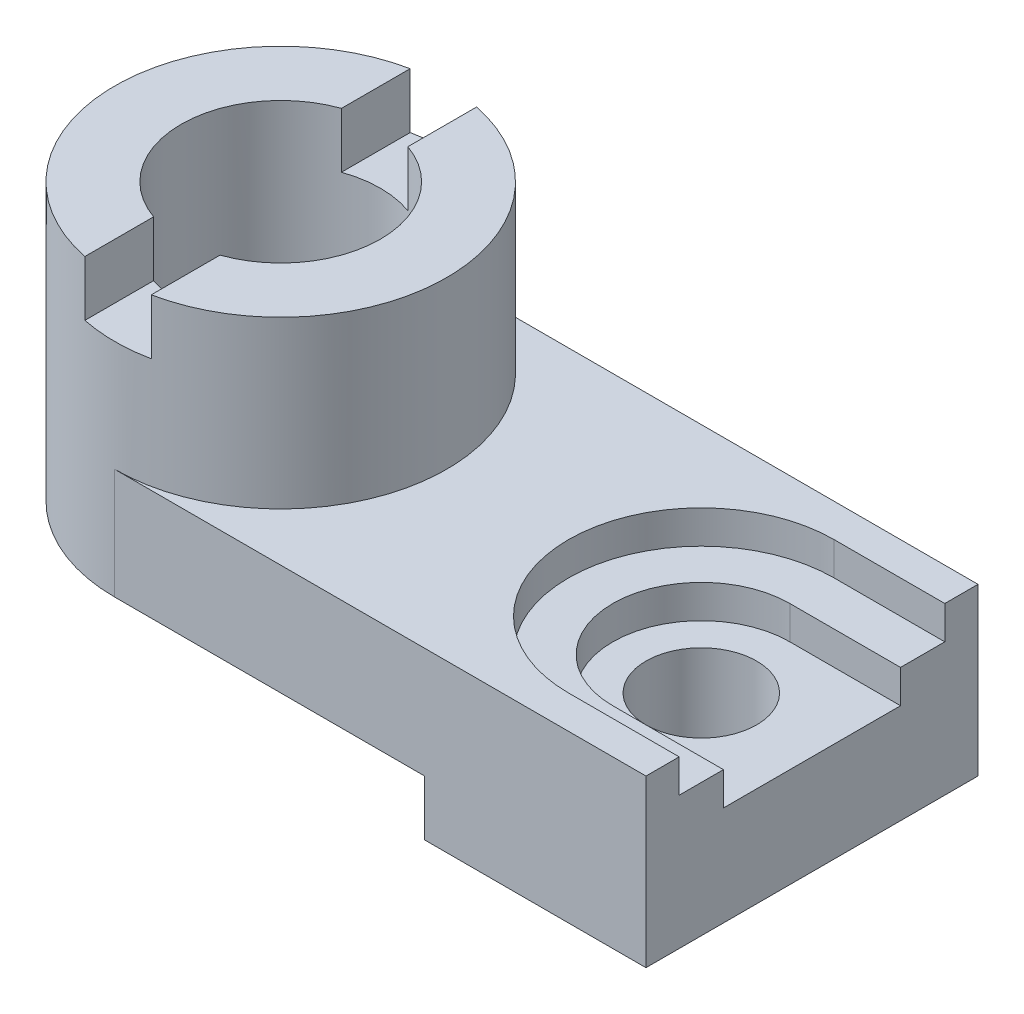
ISO-10303-21;
HEADER;
FILE_DESCRIPTION(('STEP AP214'),'2;1');
FILE_NAME('part.step','',(''),(''),'','','');
FILE_SCHEMA(('AUTOMOTIVE_DESIGN { 1 0 10303 214 1 1 1 1 }'));
ENDSEC;
DATA;
#1=APPLICATION_CONTEXT('core data for automotive mechanical design processes');
#2=APPLICATION_PROTOCOL_DEFINITION('international standard','automotive_design',2000,#1);
#3=PRODUCT_CONTEXT('',#1,'mechanical');
#4=PRODUCT('Part','Part','',(#3));
#5=PRODUCT_RELATED_PRODUCT_CATEGORY('part','',(#4));
#6=PRODUCT_DEFINITION_FORMATION('','',#4);
#7=PRODUCT_DEFINITION_CONTEXT('part definition',#1,'design');
#8=PRODUCT_DEFINITION('design','',#6,#7);
#9=PRODUCT_DEFINITION_SHAPE('','',#8);
#10=(LENGTH_UNIT() NAMED_UNIT(*) SI_UNIT(.MILLI.,.METRE.));
#11=(NAMED_UNIT(*) PLANE_ANGLE_UNIT() SI_UNIT($,.RADIAN.));
#12=(NAMED_UNIT(*) SI_UNIT($,.STERADIAN.) SOLID_ANGLE_UNIT());
#13=UNCERTAINTY_MEASURE_WITH_UNIT(LENGTH_MEASURE(1.E-05),#10,'distance_accuracy_value','');
#14=(GEOMETRIC_REPRESENTATION_CONTEXT(3) GLOBAL_UNCERTAINTY_ASSIGNED_CONTEXT((#13)) GLOBAL_UNIT_ASSIGNED_CONTEXT((#10,
#11,#12)) REPRESENTATION_CONTEXT('',''));
#15=CARTESIAN_POINT('',(0.,0.,0.));
#16=DIRECTION('',(0.,0.,1.));
#17=DIRECTION('',(1.,0.,0.));
#18=AXIS2_PLACEMENT_3D('',#15,#16,#17);
#19=CARTESIAN_POINT('',(38.,10.,0.));
#20=DIRECTION('',(0.,-1.,0.));
#21=DIRECTION('',(0.,0.,-1.));
#22=AXIS2_PLACEMENT_3D('',#19,#20,#21);
#23=CYLINDRICAL_SURFACE('',#22,5.);
#24=CARTESIAN_POINT('',(38.,-5.,0.));
#25=DIRECTION('',(0.,1.,0.));
#26=DIRECTION('',(0.,0.,1.));
#27=AXIS2_PLACEMENT_3D('',#24,#25,#26);
#28=CIRCLE('',#27,5.);
#29=CARTESIAN_POINT('',(38.,-5.,5.));
#30=VERTEX_POINT('',#29);
#31=EDGE_CURVE('E236',#30,#30,#28,.T.);
#32=ORIENTED_EDGE('',*,*,#31,.F.);
#33=EDGE_LOOP('',(#32));
#34=FACE_BOUND('',#33,.T.);
#35=CARTESIAN_POINT('',(38.,4.,0.));
#36=DIRECTION('',(0.,1.,0.));
#37=DIRECTION('',(0.,0.,1.));
#38=AXIS2_PLACEMENT_3D('',#35,#36,#37);
#39=CIRCLE('',#38,5.);
#40=CARTESIAN_POINT('',(38.,4.,5.));
#41=VERTEX_POINT('',#40);
#42=EDGE_CURVE('E209',#41,#41,#39,.F.);
#43=ORIENTED_EDGE('',*,*,#42,.F.);
#44=EDGE_LOOP('',(#43));
#45=FACE_BOUND('',#44,.T.);
#46=ADVANCED_FACE('F24',(#34,#45),#23,.F.);
#47=CARTESIAN_POINT('',(-15.,25.,0.));
#48=DIRECTION('',(0.,-1.,0.));
#49=DIRECTION('',(0.,0.,-1.));
#50=AXIS2_PLACEMENT_3D('',#47,#48,#49);
#51=PLANE('',#50);
#52=CARTESIAN_POINT('',(0.,25.,0.));
#53=DIRECTION('',(0.,-1.,0.));
#54=DIRECTION('',(0.,0.,-1.));
#55=AXIS2_PLACEMENT_3D('',#52,#53,#54);
#56=CIRCLE('',#55,15.);
#57=CARTESIAN_POINT('',(-3.,25.,14.6969384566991));
#58=VERTEX_POINT('',#57);
#59=CARTESIAN_POINT('',(-3.,25.,-14.6969384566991));
#60=VERTEX_POINT('',#59);
#61=EDGE_CURVE('E294',#58,#60,#56,.T.);
#62=ORIENTED_EDGE('',*,*,#61,.F.);
#63=DIRECTION('',(0.,0.,1.));
#64=VECTOR('',#63,1.);
#65=CARTESIAN_POINT('',(-3.,25.,-25.));
#66=LINE('',#65,#64);
#67=CARTESIAN_POINT('',(-3.,25.,8.48528137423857));
#68=VERTEX_POINT('',#67);
#69=EDGE_CURVE('E328',#68,#58,#66,.T.);
#70=ORIENTED_EDGE('',*,*,#69,.F.);
#71=CARTESIAN_POINT('',(0.,25.,0.));
#72=DIRECTION('',(0.,-1.,0.));
#73=DIRECTION('',(0.,0.,-1.));
#74=AXIS2_PLACEMENT_3D('',#71,#72,#73);
#75=CIRCLE('',#74,9.);
#76=CARTESIAN_POINT('',(-3.,25.,-8.48528137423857));
#77=VERTEX_POINT('',#76);
#78=EDGE_CURVE('E298',#68,#77,#75,.T.);
#79=ORIENTED_EDGE('',*,*,#78,.T.);
#80=EDGE_CURVE('E330',#60,#77,#66,.T.);
#81=ORIENTED_EDGE('',*,*,#80,.F.);
#82=EDGE_LOOP('',(#62,#70,#79,#81));
#83=FACE_BOUND('',#82,.T.);
#84=ADVANCED_FACE('F414',(#83),#51,.F.);
#85=CARTESIAN_POINT('',(0.,0.,0.));
#86=DIRECTION('',(0.,-1.,0.));
#87=DIRECTION('',(0.,0.,-1.));
#88=AXIS2_PLACEMENT_3D('',#85,#86,#87);
#89=CYLINDRICAL_SURFACE('',#88,15.);
#90=CARTESIAN_POINT('',(0.,10.,0.));
#91=DIRECTION('',(0.,1.,0.));
#92=DIRECTION('',(0.,0.,-1.));
#93=AXIS2_PLACEMENT_3D('',#90,#91,#92);
#94=CIRCLE('',#93,15.);
#95=CARTESIAN_POINT('',(0.,10.,15.));
#96=VERTEX_POINT('',#95);
#97=CARTESIAN_POINT('',(0.,10.,-15.));
#98=VERTEX_POINT('',#97);
#99=EDGE_CURVE('E361',#96,#98,#94,.T.);
#100=ORIENTED_EDGE('',*,*,#99,.T.);
#101=DIRECTION('',(0.,-1.,0.));
#102=VECTOR('',#101,1.);
#103=CARTESIAN_POINT('',(0.,10.,-15.));
#104=LINE('',#103,#102);
#105=CARTESIAN_POINT('',(0.,0.,-15.));
#106=VERTEX_POINT('',#105);
#107=EDGE_CURVE('E343',#98,#106,#104,.T.);
#108=ORIENTED_EDGE('',*,*,#107,.T.);
#109=CARTESIAN_POINT('',(0.,0.,0.));
#110=DIRECTION('',(0.,-1.,0.));
#111=DIRECTION('',(0.,0.,-1.));
#112=AXIS2_PLACEMENT_3D('',#109,#110,#111);
#113=CIRCLE('',#112,15.);
#114=CARTESIAN_POINT('',(0.,0.,15.));
#115=VERTEX_POINT('',#114);
#116=EDGE_CURVE('E308',#115,#106,#113,.T.);
#117=ORIENTED_EDGE('',*,*,#116,.F.);
#118=DIRECTION('',(0.,-1.,0.));
#119=VECTOR('',#118,1.);
#120=CARTESIAN_POINT('',(0.,10.,15.));
#121=LINE('',#120,#119);
#122=EDGE_CURVE('E331',#96,#115,#121,.T.);
#123=ORIENTED_EDGE('',*,*,#122,.F.);
#124=EDGE_LOOP('',(#100,#108,#117,#123));
#125=FACE_BOUND('',#124,.T.);
#126=CARTESIAN_POINT('',(0.,20.,0.));
#127=DIRECTION('',(0.,-1.,0.));
#128=DIRECTION('',(0.,0.,-1.));
#129=AXIS2_PLACEMENT_3D('',#126,#127,#128);
#130=CIRCLE('',#129,15.);
#131=CARTESIAN_POINT('',(-3.,20.,-14.6969384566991));
#132=VERTEX_POINT('',#131);
#133=CARTESIAN_POINT('',(3.,20.,-14.6969384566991));
#134=VERTEX_POINT('',#133);
#135=EDGE_CURVE('E318',#132,#134,#130,.T.);
#136=ORIENTED_EDGE('',*,*,#135,.T.);
#137=DIRECTION('',(0.,-1.,0.));
#138=VECTOR('',#137,1.);
#139=CARTESIAN_POINT('',(2.99999999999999,0.,-14.6969384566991));
#140=LINE('',#139,#138);
#141=CARTESIAN_POINT('',(3.,25.,-14.6969384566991));
#142=VERTEX_POINT('',#141);
#143=EDGE_CURVE('E314',#134,#142,#140,.F.);
#144=ORIENTED_EDGE('',*,*,#143,.T.);
#145=CARTESIAN_POINT('',(3.,25.,14.6969384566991));
#146=VERTEX_POINT('',#145);
#147=EDGE_CURVE('E291',#142,#146,#56,.T.);
#148=ORIENTED_EDGE('',*,*,#147,.T.);
#149=DIRECTION('',(0.,-1.,0.));
#150=VECTOR('',#149,1.);
#151=CARTESIAN_POINT('',(2.99999999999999,0.,14.6969384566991));
#152=LINE('',#151,#150);
#153=CARTESIAN_POINT('',(3.,20.,14.6969384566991));
#154=VERTEX_POINT('',#153);
#155=EDGE_CURVE('E311',#146,#154,#152,.T.);
#156=ORIENTED_EDGE('',*,*,#155,.T.);
#157=CARTESIAN_POINT('',(-3.,20.,14.6969384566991));
#158=VERTEX_POINT('',#157);
#159=EDGE_CURVE('E317',#154,#158,#130,.T.);
#160=ORIENTED_EDGE('',*,*,#159,.T.);
#161=DIRECTION('',(0.,-1.,0.));
#162=VECTOR('',#161,1.);
#163=CARTESIAN_POINT('',(-3.,0.,14.6969384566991));
#164=LINE('',#163,#162);
#165=EDGE_CURVE('E324',#158,#58,#164,.F.);
#166=ORIENTED_EDGE('',*,*,#165,.T.);
#167=ORIENTED_EDGE('',*,*,#61,.T.);
#168=DIRECTION('',(0.,-1.,0.));
#169=VECTOR('',#168,1.);
#170=CARTESIAN_POINT('',(-3.,0.,-14.6969384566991));
#171=LINE('',#170,#169);
#172=EDGE_CURVE('E321',#60,#132,#171,.T.);
#173=ORIENTED_EDGE('',*,*,#172,.T.);
#174=EDGE_LOOP('',(#136,#144,#148,#156,#160,#166,#167,#173));
#175=FACE_BOUND('',#174,.T.);
#176=ADVANCED_FACE('F26',(#125,#175),#89,.T.);
#177=ORIENTED_EDGE('',*,*,#147,.F.);
#178=DIRECTION('',(0.,0.,1.));
#179=VECTOR('',#178,1.);
#180=CARTESIAN_POINT('',(3.,25.,-25.));
#181=LINE('',#180,#179);
#182=CARTESIAN_POINT('',(3.,25.,-8.48528137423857));
#183=VERTEX_POINT('',#182);
#184=EDGE_CURVE('E327',#142,#183,#181,.T.);
#185=ORIENTED_EDGE('',*,*,#184,.T.);
#186=CARTESIAN_POINT('',(3.,25.,8.48528137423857));
#187=VERTEX_POINT('',#186);
#188=EDGE_CURVE('E295',#183,#187,#75,.T.);
#189=ORIENTED_EDGE('',*,*,#188,.T.);
#190=EDGE_CURVE('E340',#187,#146,#181,.T.);
#191=ORIENTED_EDGE('',*,*,#190,.T.);
#192=EDGE_LOOP('',(#177,#185,#189,#191));
#193=FACE_BOUND('',#192,.T.);
#194=ADVANCED_FACE('F422',(#193),#51,.F.);
#195=CARTESIAN_POINT('',(0.,0.,0.));
#196=DIRECTION('',(0.,-1.,0.));
#197=DIRECTION('',(0.,0.,-1.));
#198=AXIS2_PLACEMENT_3D('',#195,#196,#197);
#199=CYLINDRICAL_SURFACE('',#198,9.);
#200=ORIENTED_EDGE('',*,*,#188,.F.);
#201=DIRECTION('',(0.,-1.,0.));
#202=VECTOR('',#201,1.);
#203=CARTESIAN_POINT('',(2.99999999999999,0.,-8.48528137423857));
#204=LINE('',#203,#202);
#205=CARTESIAN_POINT('',(3.,20.,-8.48528137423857));
#206=VERTEX_POINT('',#205);
#207=EDGE_CURVE('E11',#183,#206,#204,.T.);
#208=ORIENTED_EDGE('',*,*,#207,.T.);
#209=CARTESIAN_POINT('',(0.,20.,0.));
#210=DIRECTION('',(0.,-1.,0.));
#211=DIRECTION('',(0.,0.,-1.));
#212=AXIS2_PLACEMENT_3D('',#209,#210,#211);
#213=CIRCLE('',#212,9.);
#214=CARTESIAN_POINT('',(-3.,20.,-8.48528137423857));
#215=VERTEX_POINT('',#214);
#216=EDGE_CURVE('E281',#206,#215,#213,.F.);
#217=ORIENTED_EDGE('',*,*,#216,.T.);
#218=DIRECTION('',(0.,-1.,0.));
#219=VECTOR('',#218,1.);
#220=CARTESIAN_POINT('',(-3.,0.,-8.48528137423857));
#221=LINE('',#220,#219);
#222=EDGE_CURVE('E33',#215,#77,#221,.F.);
#223=ORIENTED_EDGE('',*,*,#222,.T.);
#224=ORIENTED_EDGE('',*,*,#78,.F.);
#225=DIRECTION('',(0.,-1.,0.));
#226=VECTOR('',#225,1.);
#227=CARTESIAN_POINT('',(-3.,0.,8.48528137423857));
#228=LINE('',#227,#226);
#229=CARTESIAN_POINT('',(-3.,20.,8.48528137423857));
#230=VERTEX_POINT('',#229);
#231=EDGE_CURVE('E288',#68,#230,#228,.T.);
#232=ORIENTED_EDGE('',*,*,#231,.T.);
#233=CARTESIAN_POINT('',(3.,20.,8.48528137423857));
#234=VERTEX_POINT('',#233);
#235=EDGE_CURVE('E285',#230,#234,#213,.F.);
#236=ORIENTED_EDGE('',*,*,#235,.T.);
#237=DIRECTION('',(0.,-1.,0.));
#238=VECTOR('',#237,1.);
#239=CARTESIAN_POINT('',(2.99999999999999,0.,8.48528137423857));
#240=LINE('',#239,#238);
#241=EDGE_CURVE('E282',#234,#187,#240,.F.);
#242=ORIENTED_EDGE('',*,*,#241,.T.);
#243=EDGE_LOOP('',(#200,#208,#217,#223,#224,#232,#236,#242));
#244=FACE_BOUND('',#243,.T.);
#245=CARTESIAN_POINT('',(0.,5.00000000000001,0.));
#246=DIRECTION('',(0.,-1.,0.));
#247=DIRECTION('',(0.,0.,-1.));
#248=AXIS2_PLACEMENT_3D('',#245,#246,#247);
#249=CIRCLE('',#248,9.);
#250=CARTESIAN_POINT('',(0.,5.00000000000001,-9.));
#251=VERTEX_POINT('',#250);
#252=EDGE_CURVE('E299',#251,#251,#249,.T.);
#253=ORIENTED_EDGE('',*,*,#252,.T.);
#254=EDGE_LOOP('',(#253));
#255=FACE_BOUND('',#254,.T.);
#256=ADVANCED_FACE('F459',(#244,#255),#199,.F.);
#257=CARTESIAN_POINT('',(-9.,5.,0.));
#258=DIRECTION('',(0.,1.,0.));
#259=DIRECTION('',(0.,0.,1.));
#260=AXIS2_PLACEMENT_3D('',#257,#258,#259);
#261=PLANE('',#260);
#262=ORIENTED_EDGE('',*,*,#252,.F.);
#263=EDGE_LOOP('',(#262));
#264=FACE_BOUND('',#263,.T.);
#265=CARTESIAN_POINT('',(0.,5.,0.));
#266=DIRECTION('',(0.,-1.,0.));
#267=DIRECTION('',(0.,0.,-1.));
#268=AXIS2_PLACEMENT_3D('',#265,#266,#267);
#269=CIRCLE('',#268,12.);
#270=CARTESIAN_POINT('',(0.,5.,-12.));
#271=VERTEX_POINT('',#270);
#272=EDGE_CURVE('E302',#271,#271,#269,.T.);
#273=ORIENTED_EDGE('',*,*,#272,.T.);
#274=EDGE_LOOP('',(#273));
#275=FACE_BOUND('',#274,.T.);
#276=ADVANCED_FACE('F455',(#264,#275),#261,.F.);
#277=CARTESIAN_POINT('',(0.,0.,0.));
#278=DIRECTION('',(0.,-1.,0.));
#279=DIRECTION('',(0.,0.,-1.));
#280=AXIS2_PLACEMENT_3D('',#277,#278,#279);
#281=CYLINDRICAL_SURFACE('',#280,12.);
#282=ORIENTED_EDGE('',*,*,#272,.F.);
#283=EDGE_LOOP('',(#282));
#284=FACE_BOUND('',#283,.T.);
#285=CARTESIAN_POINT('',(0.,0.,0.));
#286=DIRECTION('',(0.,-1.,0.));
#287=DIRECTION('',(0.,0.,-1.));
#288=AXIS2_PLACEMENT_3D('',#285,#286,#287);
#289=CIRCLE('',#288,12.);
#290=CARTESIAN_POINT('',(0.,0.,-12.));
#291=VERTEX_POINT('',#290);
#292=EDGE_CURVE('E305',#291,#291,#289,.T.);
#293=ORIENTED_EDGE('',*,*,#292,.T.);
#294=EDGE_LOOP('',(#293));
#295=FACE_BOUND('',#294,.T.);
#296=ADVANCED_FACE('F451',(#284,#295),#281,.F.);
#297=CARTESIAN_POINT('',(-12.,0.,0.));
#298=DIRECTION('',(0.,1.,0.));
#299=DIRECTION('',(0.,0.,1.));
#300=AXIS2_PLACEMENT_3D('',#297,#298,#299);
#301=PLANE('',#300);
#302=ORIENTED_EDGE('',*,*,#292,.F.);
#303=EDGE_LOOP('',(#302));
#304=FACE_BOUND('',#303,.T.);
#305=DIRECTION('',(1.,0.,0.));
#306=VECTOR('',#305,1.);
#307=CARTESIAN_POINT('',(0.,0.,-15.));
#308=LINE('',#307,#306);
#309=CARTESIAN_POINT('',(28.,0.,-15.));
#310=VERTEX_POINT('',#309);
#311=EDGE_CURVE('E258',#106,#310,#308,.T.);
#312=ORIENTED_EDGE('',*,*,#311,.T.);
#313=DIRECTION('',(0.,0.,1.));
#314=VECTOR('',#313,1.);
#315=CARTESIAN_POINT('',(28.,0.,-15.));
#316=LINE('',#315,#314);
#317=CARTESIAN_POINT('',(28.,0.,15.));
#318=VERTEX_POINT('',#317);
#319=EDGE_CURVE('E244',#310,#318,#316,.T.);
#320=ORIENTED_EDGE('',*,*,#319,.T.);
#321=DIRECTION('',(-1.,0.,0.));
#322=VECTOR('',#321,1.);
#323=CARTESIAN_POINT('',(0.,0.,15.));
#324=LINE('',#323,#322);
#325=EDGE_CURVE('E253',#318,#115,#324,.T.);
#326=ORIENTED_EDGE('',*,*,#325,.T.);
#327=ORIENTED_EDGE('',*,*,#116,.T.);
#328=EDGE_LOOP('',(#312,#320,#326,#327));
#329=FACE_BOUND('',#328,.T.);
#330=ADVANCED_FACE('F367',(#304,#329),#301,.F.);
#331=CARTESIAN_POINT('',(-3.,25.,-25.));
#332=DIRECTION('',(-1.,0.,0.));
#333=DIRECTION('',(0.,-1.,0.));
#334=AXIS2_PLACEMENT_3D('',#331,#332,#333);
#335=PLANE('',#334);
#336=DIRECTION('',(0.,0.,1.));
#337=VECTOR('',#336,1.);
#338=CARTESIAN_POINT('',(-3.,20.,-25.));
#339=LINE('',#338,#337);
#340=EDGE_CURVE('E332',#230,#158,#339,.T.);
#341=ORIENTED_EDGE('',*,*,#340,.F.);
#342=ORIENTED_EDGE('',*,*,#231,.F.);
#343=ORIENTED_EDGE('',*,*,#69,.T.);
#344=ORIENTED_EDGE('',*,*,#165,.F.);
#345=EDGE_LOOP('',(#341,#342,#343,#344));
#346=FACE_BOUND('',#345,.T.);
#347=ADVANCED_FACE('F443',(#346),#335,.F.);
#348=CARTESIAN_POINT('',(-3.,20.,-25.));
#349=DIRECTION('',(0.,-1.,0.));
#350=DIRECTION('',(0.,0.,-1.));
#351=AXIS2_PLACEMENT_3D('',#348,#349,#350);
#352=PLANE('',#351);
#353=DIRECTION('',(0.,0.,1.));
#354=VECTOR('',#353,1.);
#355=CARTESIAN_POINT('',(3.,20.,-25.));
#356=LINE('',#355,#354);
#357=EDGE_CURVE('E336',#234,#154,#356,.T.);
#358=ORIENTED_EDGE('',*,*,#357,.F.);
#359=ORIENTED_EDGE('',*,*,#235,.F.);
#360=ORIENTED_EDGE('',*,*,#340,.T.);
#361=ORIENTED_EDGE('',*,*,#159,.F.);
#362=EDGE_LOOP('',(#358,#359,#360,#361));
#363=FACE_BOUND('',#362,.T.);
#364=ADVANCED_FACE('F439',(#363),#352,.F.);
#365=CARTESIAN_POINT('',(3.,25.,-25.));
#366=DIRECTION('',(1.,0.,0.));
#367=DIRECTION('',(0.,1.,0.));
#368=AXIS2_PLACEMENT_3D('',#365,#366,#367);
#369=PLANE('',#368);
#370=ORIENTED_EDGE('',*,*,#190,.F.);
#371=ORIENTED_EDGE('',*,*,#241,.F.);
#372=ORIENTED_EDGE('',*,*,#357,.T.);
#373=ORIENTED_EDGE('',*,*,#155,.F.);
#374=EDGE_LOOP('',(#370,#371,#372,#373));
#375=FACE_BOUND('',#374,.T.);
#376=ADVANCED_FACE('F435',(#375),#369,.F.);
#377=EDGE_CURVE('E339',#134,#206,#356,.T.);
#378=ORIENTED_EDGE('',*,*,#377,.T.);
#379=ORIENTED_EDGE('',*,*,#207,.F.);
#380=ORIENTED_EDGE('',*,*,#184,.F.);
#381=ORIENTED_EDGE('',*,*,#143,.F.);
#382=EDGE_LOOP('',(#378,#379,#380,#381));
#383=FACE_BOUND('',#382,.T.);
#384=ADVANCED_FACE('F438',(#383),#369,.F.);
#385=EDGE_CURVE('E335',#132,#215,#339,.T.);
#386=ORIENTED_EDGE('',*,*,#385,.T.);
#387=ORIENTED_EDGE('',*,*,#216,.F.);
#388=ORIENTED_EDGE('',*,*,#377,.F.);
#389=ORIENTED_EDGE('',*,*,#135,.F.);
#390=EDGE_LOOP('',(#386,#387,#388,#389));
#391=FACE_BOUND('',#390,.T.);
#392=ADVANCED_FACE('F445',(#391),#352,.F.);
#393=ORIENTED_EDGE('',*,*,#80,.T.);
#394=ORIENTED_EDGE('',*,*,#222,.F.);
#395=ORIENTED_EDGE('',*,*,#385,.F.);
#396=ORIENTED_EDGE('',*,*,#172,.F.);
#397=EDGE_LOOP('',(#393,#394,#395,#396));
#398=FACE_BOUND('',#397,.T.);
#399=ADVANCED_FACE('F431',(#398),#335,.F.);
#400=CARTESIAN_POINT('',(0.,10.,15.));
#401=DIRECTION('',(0.,0.,1.));
#402=DIRECTION('',(1.,0.,0.));
#403=AXIS2_PLACEMENT_3D('',#400,#401,#402);
#404=PLANE('',#403);
#405=ORIENTED_EDGE('',*,*,#325,.F.);
#406=DIRECTION('',(0.,1.,0.));
#407=VECTOR('',#406,1.);
#408=CARTESIAN_POINT('',(28.,-5.,15.));
#409=LINE('',#408,#407);
#410=CARTESIAN_POINT('',(28.,-5.,15.));
#411=VERTEX_POINT('',#410);
#412=EDGE_CURVE('E256',#411,#318,#409,.T.);
#413=ORIENTED_EDGE('',*,*,#412,.F.);
#414=DIRECTION('',(1.,0.,0.));
#415=VECTOR('',#414,1.);
#416=CARTESIAN_POINT('',(48.,-5.,15.));
#417=LINE('',#416,#415);
#418=CARTESIAN_POINT('',(48.,-5.,15.));
#419=VERTEX_POINT('',#418);
#420=EDGE_CURVE('E266',#411,#419,#417,.T.);
#421=ORIENTED_EDGE('',*,*,#420,.T.);
#422=DIRECTION('',(0.,-1.,0.));
#423=VECTOR('',#422,1.);
#424=CARTESIAN_POINT('',(48.,10.,15.));
#425=LINE('',#424,#423);
#426=CARTESIAN_POINT('',(48.,10.,15.));
#427=VERTEX_POINT('',#426);
#428=EDGE_CURVE('E349',#427,#419,#425,.T.);
#429=ORIENTED_EDGE('',*,*,#428,.F.);
#430=DIRECTION('',(-1.,0.,0.));
#431=VECTOR('',#430,1.);
#432=CARTESIAN_POINT('',(0.,10.,15.));
#433=LINE('',#432,#431);
#434=EDGE_CURVE('E347',#427,#96,#433,.T.);
#435=ORIENTED_EDGE('',*,*,#434,.T.);
#436=ORIENTED_EDGE('',*,*,#122,.T.);
#437=EDGE_LOOP('',(#405,#413,#421,#429,#435,#436));
#438=FACE_BOUND('',#437,.T.);
#439=ADVANCED_FACE('F370',(#438),#404,.T.);
#440=CARTESIAN_POINT('',(48.,10.,-15.));
#441=DIRECTION('',(1.,0.,0.));
#442=DIRECTION('',(0.,0.,-1.));
#443=AXIS2_PLACEMENT_3D('',#440,#441,#442);
#444=PLANE('',#443);
#445=DIRECTION('',(0.,1.,0.));
#446=VECTOR('',#445,1.);
#447=CARTESIAN_POINT('',(48.,4.,-8.));
#448=LINE('',#447,#446);
#449=CARTESIAN_POINT('',(48.,4.,-8.));
#450=VERTEX_POINT('',#449);
#451=CARTESIAN_POINT('',(48.,7.,-8.));
#452=VERTEX_POINT('',#451);
#453=EDGE_CURVE('E41',#450,#452,#448,.T.);
#454=ORIENTED_EDGE('',*,*,#453,.F.);
#455=DIRECTION('',(0.,0.,-1.));
#456=VECTOR('',#455,1.);
#457=CARTESIAN_POINT('',(48.,4.,7.99999999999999));
#458=LINE('',#457,#456);
#459=CARTESIAN_POINT('',(48.,4.,7.99999999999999));
#460=VERTEX_POINT('',#459);
#461=EDGE_CURVE('E195',#460,#450,#458,.T.);
#462=ORIENTED_EDGE('',*,*,#461,.F.);
#463=DIRECTION('',(0.,1.,0.));
#464=VECTOR('',#463,1.);
#465=CARTESIAN_POINT('',(48.,4.,7.99999999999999));
#466=LINE('',#465,#464);
#467=CARTESIAN_POINT('',(48.,7.,7.99999999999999));
#468=VERTEX_POINT('',#467);
#469=EDGE_CURVE('E206',#460,#468,#466,.T.);
#470=ORIENTED_EDGE('',*,*,#469,.T.);
#471=DIRECTION('',(0.,0.,-1.));
#472=VECTOR('',#471,1.);
#473=CARTESIAN_POINT('',(48.,7.,-12.));
#474=LINE('',#473,#472);
#475=CARTESIAN_POINT('',(48.,7.,12.));
#476=VERTEX_POINT('',#475);
#477=EDGE_CURVE('E221',#476,#468,#474,.T.);
#478=ORIENTED_EDGE('',*,*,#477,.F.);
#479=DIRECTION('',(0.,1.,0.));
#480=VECTOR('',#479,1.);
#481=CARTESIAN_POINT('',(48.,7.,12.));
#482=LINE('',#481,#480);
#483=CARTESIAN_POINT('',(48.,10.,12.));
#484=VERTEX_POINT('',#483);
#485=EDGE_CURVE('E233',#476,#484,#482,.T.);
#486=ORIENTED_EDGE('',*,*,#485,.T.);
#487=DIRECTION('',(0.,0.,1.));
#488=VECTOR('',#487,1.);
#489=CARTESIAN_POINT('',(48.,10.,-15.));
#490=LINE('',#489,#488);
#491=EDGE_CURVE('E358',#484,#427,#490,.T.);
#492=ORIENTED_EDGE('',*,*,#491,.T.);
#493=ORIENTED_EDGE('',*,*,#428,.T.);
#494=DIRECTION('',(0.,0.,-1.));
#495=VECTOR('',#494,1.);
#496=CARTESIAN_POINT('',(48.,-5.,-15.));
#497=LINE('',#496,#495);
#498=CARTESIAN_POINT('',(48.,-5.,-15.));
#499=VERTEX_POINT('',#498);
#500=EDGE_CURVE('E261',#419,#499,#497,.T.);
#501=ORIENTED_EDGE('',*,*,#500,.T.);
#502=DIRECTION('',(0.,-1.,0.));
#503=VECTOR('',#502,1.);
#504=CARTESIAN_POINT('',(48.,10.,-15.));
#505=LINE('',#504,#503);
#506=CARTESIAN_POINT('',(48.,10.,-15.));
#507=VERTEX_POINT('',#506);
#508=EDGE_CURVE('E346',#507,#499,#505,.T.);
#509=ORIENTED_EDGE('',*,*,#508,.F.);
#510=CARTESIAN_POINT('',(48.,10.,-12.));
#511=VERTEX_POINT('',#510);
#512=EDGE_CURVE('E355',#507,#511,#490,.T.);
#513=ORIENTED_EDGE('',*,*,#512,.T.);
#514=DIRECTION('',(0.,1.,0.));
#515=VECTOR('',#514,1.);
#516=CARTESIAN_POINT('',(48.,7.,-12.));
#517=LINE('',#516,#515);
#518=CARTESIAN_POINT('',(48.,7.,-12.));
#519=VERTEX_POINT('',#518);
#520=EDGE_CURVE('E232',#519,#511,#517,.T.);
#521=ORIENTED_EDGE('',*,*,#520,.F.);
#522=EDGE_CURVE('E220',#452,#519,#474,.T.);
#523=ORIENTED_EDGE('',*,*,#522,.F.);
#524=EDGE_LOOP('',(#454,#462,#470,#478,#486,#492,#493,#501,#509,#513,#521,#523));
#525=FACE_BOUND('',#524,.T.);
#526=ADVANCED_FACE('F382',(#525),#444,.T.);
#527=CARTESIAN_POINT('',(0.,10.,-15.));
#528=DIRECTION('',(0.,0.,-1.));
#529=DIRECTION('',(-1.,0.,0.));
#530=AXIS2_PLACEMENT_3D('',#527,#528,#529);
#531=PLANE('',#530);
#532=ORIENTED_EDGE('',*,*,#311,.F.);
#533=ORIENTED_EDGE('',*,*,#107,.F.);
#534=DIRECTION('',(1.,0.,0.));
#535=VECTOR('',#534,1.);
#536=CARTESIAN_POINT('',(0.,10.,-15.));
#537=LINE('',#536,#535);
#538=EDGE_CURVE('E359',#98,#507,#537,.T.);
#539=ORIENTED_EDGE('',*,*,#538,.T.);
#540=ORIENTED_EDGE('',*,*,#508,.T.);
#541=DIRECTION('',(-1.,0.,0.));
#542=VECTOR('',#541,1.);
#543=CARTESIAN_POINT('',(28.,-5.,-15.));
#544=LINE('',#543,#542);
#545=CARTESIAN_POINT('',(28.,-5.,-15.));
#546=VERTEX_POINT('',#545);
#547=EDGE_CURVE('E247',#499,#546,#544,.T.);
#548=ORIENTED_EDGE('',*,*,#547,.T.);
#549=DIRECTION('',(0.,1.,0.));
#550=VECTOR('',#549,1.);
#551=CARTESIAN_POINT('',(28.,-5.,-15.));
#552=LINE('',#551,#550);
#553=EDGE_CURVE('E259',#546,#310,#552,.T.);
#554=ORIENTED_EDGE('',*,*,#553,.T.);
#555=EDGE_LOOP('',(#532,#533,#539,#540,#548,#554));
#556=FACE_BOUND('',#555,.T.);
#557=ADVANCED_FACE('F375',(#556),#531,.T.);
#558=CARTESIAN_POINT('',(0.,10.,0.));
#559=DIRECTION('',(0.,-1.,0.));
#560=DIRECTION('',(0.,0.,-1.));
#561=AXIS2_PLACEMENT_3D('',#558,#559,#560);
#562=PLANE('',#561);
#563=ORIENTED_EDGE('',*,*,#491,.F.);
#564=DIRECTION('',(1.,0.,0.));
#565=VECTOR('',#564,1.);
#566=CARTESIAN_POINT('',(48.,10.,12.));
#567=LINE('',#566,#565);
#568=CARTESIAN_POINT('',(38.,10.,12.));
#569=VERTEX_POINT('',#568);
#570=EDGE_CURVE('E218',#569,#484,#567,.T.);
#571=ORIENTED_EDGE('',*,*,#570,.F.);
#572=CARTESIAN_POINT('',(38.,10.,0.));
#573=DIRECTION('',(0.,1.,0.));
#574=DIRECTION('',(0.,0.,1.));
#575=AXIS2_PLACEMENT_3D('',#572,#573,#574);
#576=CIRCLE('',#575,12.);
#577=CARTESIAN_POINT('',(38.,10.,-12.));
#578=VERTEX_POINT('',#577);
#579=EDGE_CURVE('E215',#578,#569,#576,.T.);
#580=ORIENTED_EDGE('',*,*,#579,.F.);
#581=DIRECTION('',(-1.,0.,0.));
#582=VECTOR('',#581,1.);
#583=CARTESIAN_POINT('',(48.,10.,-12.));
#584=LINE('',#583,#582);
#585=EDGE_CURVE('E49',#511,#578,#584,.T.);
#586=ORIENTED_EDGE('',*,*,#585,.F.);
#587=ORIENTED_EDGE('',*,*,#512,.F.);
#588=ORIENTED_EDGE('',*,*,#538,.F.);
#589=ORIENTED_EDGE('',*,*,#99,.F.);
#590=ORIENTED_EDGE('',*,*,#434,.F.);
#591=EDGE_LOOP('',(#563,#571,#580,#586,#587,#588,#589,#590));
#592=FACE_BOUND('',#591,.T.);
#593=ADVANCED_FACE('F379',(#592),#562,.F.);
#594=CARTESIAN_POINT('',(28.,-5.,-15.));
#595=DIRECTION('',(-1.,0.,0.));
#596=DIRECTION('',(0.,0.,1.));
#597=AXIS2_PLACEMENT_3D('',#594,#595,#596);
#598=PLANE('',#597);
#599=ORIENTED_EDGE('',*,*,#319,.F.);
#600=ORIENTED_EDGE('',*,*,#553,.F.);
#601=DIRECTION('',(0.,0.,1.));
#602=VECTOR('',#601,1.);
#603=CARTESIAN_POINT('',(28.,-5.,-15.));
#604=LINE('',#603,#602);
#605=EDGE_CURVE('E271',#546,#411,#604,.T.);
#606=ORIENTED_EDGE('',*,*,#605,.T.);
#607=ORIENTED_EDGE('',*,*,#412,.T.);
#608=EDGE_LOOP('',(#599,#600,#606,#607));
#609=FACE_BOUND('',#608,.T.);
#610=ADVANCED_FACE('F390',(#609),#598,.T.);
#611=CARTESIAN_POINT('',(48.,-5.,-15.));
#612=DIRECTION('',(0.,-1.,0.));
#613=DIRECTION('',(0.,0.,-1.));
#614=AXIS2_PLACEMENT_3D('',#611,#612,#613);
#615=PLANE('',#614);
#616=ORIENTED_EDGE('',*,*,#31,.T.);
#617=EDGE_LOOP('',(#616));
#618=FACE_BOUND('',#617,.T.);
#619=ORIENTED_EDGE('',*,*,#547,.F.);
#620=ORIENTED_EDGE('',*,*,#500,.F.);
#621=ORIENTED_EDGE('',*,*,#420,.F.);
#622=ORIENTED_EDGE('',*,*,#605,.F.);
#623=EDGE_LOOP('',(#619,#620,#621,#622));
#624=FACE_BOUND('',#623,.T.);
#625=ADVANCED_FACE('F386',(#618,#624),#615,.T.);
#626=CARTESIAN_POINT('',(38.,7.,0.));
#627=DIRECTION('',(0.,1.,0.));
#628=DIRECTION('',(0.,0.,1.));
#629=AXIS2_PLACEMENT_3D('',#626,#627,#628);
#630=PLANE('',#629);
#631=DIRECTION('',(1.,0.,0.));
#632=VECTOR('',#631,1.);
#633=CARTESIAN_POINT('',(48.,7.,7.99999999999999));
#634=LINE('',#633,#632);
#635=CARTESIAN_POINT('',(38.,7.,8.));
#636=VERTEX_POINT('',#635);
#637=EDGE_CURVE('E193',#636,#468,#634,.T.);
#638=ORIENTED_EDGE('',*,*,#637,.F.);
#639=CARTESIAN_POINT('',(38.,7.,0.));
#640=DIRECTION('',(0.,1.,0.));
#641=DIRECTION('',(0.,0.,1.));
#642=AXIS2_PLACEMENT_3D('',#639,#640,#641);
#643=CIRCLE('',#642,8.);
#644=CARTESIAN_POINT('',(38.,7.,-8.));
#645=VERTEX_POINT('',#644);
#646=EDGE_CURVE('E179',#645,#636,#643,.T.);
#647=ORIENTED_EDGE('',*,*,#646,.F.);
#648=DIRECTION('',(-1.,0.,0.));
#649=VECTOR('',#648,1.);
#650=CARTESIAN_POINT('',(48.,7.,-8.));
#651=LINE('',#650,#649);
#652=EDGE_CURVE('E186',#452,#645,#651,.T.);
#653=ORIENTED_EDGE('',*,*,#652,.F.);
#654=ORIENTED_EDGE('',*,*,#522,.T.);
#655=DIRECTION('',(-1.,0.,0.));
#656=VECTOR('',#655,1.);
#657=CARTESIAN_POINT('',(48.,7.,-12.));
#658=LINE('',#657,#656);
#659=CARTESIAN_POINT('',(38.,7.,-12.));
#660=VERTEX_POINT('',#659);
#661=EDGE_CURVE('E223',#519,#660,#658,.T.);
#662=ORIENTED_EDGE('',*,*,#661,.T.);
#663=CARTESIAN_POINT('',(38.,7.,0.));
#664=DIRECTION('',(0.,1.,0.));
#665=DIRECTION('',(0.,0.,1.));
#666=AXIS2_PLACEMENT_3D('',#663,#664,#665);
#667=CIRCLE('',#666,12.);
#668=CARTESIAN_POINT('',(38.,7.,12.));
#669=VERTEX_POINT('',#668);
#670=EDGE_CURVE('E226',#660,#669,#667,.T.);
#671=ORIENTED_EDGE('',*,*,#670,.T.);
#672=DIRECTION('',(1.,0.,0.));
#673=VECTOR('',#672,1.);
#674=CARTESIAN_POINT('',(48.,7.,12.));
#675=LINE('',#674,#673);
#676=EDGE_CURVE('E229',#669,#476,#675,.T.);
#677=ORIENTED_EDGE('',*,*,#676,.T.);
#678=ORIENTED_EDGE('',*,*,#477,.T.);
#679=EDGE_LOOP('',(#638,#647,#653,#654,#662,#671,#677,#678));
#680=FACE_BOUND('',#679,.T.);
#681=ADVANCED_FACE('F191',(#680),#630,.T.);
#682=CARTESIAN_POINT('',(48.,7.,12.));
#683=DIRECTION('',(0.,0.,1.));
#684=DIRECTION('',(1.,0.,0.));
#685=AXIS2_PLACEMENT_3D('',#682,#683,#684);
#686=PLANE('',#685);
#687=ORIENTED_EDGE('',*,*,#570,.T.);
#688=ORIENTED_EDGE('',*,*,#485,.F.);
#689=ORIENTED_EDGE('',*,*,#676,.F.);
#690=DIRECTION('',(0.,1.,0.));
#691=VECTOR('',#690,1.);
#692=CARTESIAN_POINT('',(38.,7.,12.));
#693=LINE('',#692,#691);
#694=EDGE_CURVE('E237',#669,#569,#693,.T.);
#695=ORIENTED_EDGE('',*,*,#694,.T.);
#696=EDGE_LOOP('',(#687,#688,#689,#695));
#697=FACE_BOUND('',#696,.T.);
#698=ADVANCED_FACE('F395',(#697),#686,.F.);
#699=CARTESIAN_POINT('',(38.,7.,0.));
#700=DIRECTION('',(0.,1.,0.));
#701=DIRECTION('',(0.,0.,1.));
#702=AXIS2_PLACEMENT_3D('',#699,#700,#701);
#703=CYLINDRICAL_SURFACE('',#702,12.);
#704=ORIENTED_EDGE('',*,*,#579,.T.);
#705=ORIENTED_EDGE('',*,*,#694,.F.);
#706=ORIENTED_EDGE('',*,*,#670,.F.);
#707=DIRECTION('',(0.,1.,0.));
#708=VECTOR('',#707,1.);
#709=CARTESIAN_POINT('',(38.,7.,-12.));
#710=LINE('',#709,#708);
#711=EDGE_CURVE('E239',#660,#578,#710,.T.);
#712=ORIENTED_EDGE('',*,*,#711,.T.);
#713=EDGE_LOOP('',(#704,#705,#706,#712));
#714=FACE_BOUND('',#713,.T.);
#715=ADVANCED_FACE('F399',(#714),#703,.F.);
#716=CARTESIAN_POINT('',(48.,7.,-12.));
#717=DIRECTION('',(0.,0.,-1.));
#718=DIRECTION('',(-1.,0.,0.));
#719=AXIS2_PLACEMENT_3D('',#716,#717,#718);
#720=PLANE('',#719);
#721=ORIENTED_EDGE('',*,*,#585,.T.);
#722=ORIENTED_EDGE('',*,*,#711,.F.);
#723=ORIENTED_EDGE('',*,*,#661,.F.);
#724=ORIENTED_EDGE('',*,*,#520,.T.);
#725=EDGE_LOOP('',(#721,#722,#723,#724));
#726=FACE_BOUND('',#725,.T.);
#727=ADVANCED_FACE('F400',(#726),#720,.F.);
#728=CARTESIAN_POINT('',(38.,4.,0.));
#729=DIRECTION('',(0.,1.,0.));
#730=DIRECTION('',(0.,0.,1.));
#731=AXIS2_PLACEMENT_3D('',#728,#729,#730);
#732=PLANE('',#731);
#733=ORIENTED_EDGE('',*,*,#461,.T.);
#734=DIRECTION('',(-1.,0.,0.));
#735=VECTOR('',#734,1.);
#736=CARTESIAN_POINT('',(48.,4.,-8.));
#737=LINE('',#736,#735);
#738=CARTESIAN_POINT('',(38.,4.,-8.));
#739=VERTEX_POINT('',#738);
#740=EDGE_CURVE('E200',#450,#739,#737,.T.);
#741=ORIENTED_EDGE('',*,*,#740,.T.);
#742=CARTESIAN_POINT('',(38.,4.,0.));
#743=DIRECTION('',(0.,1.,0.));
#744=DIRECTION('',(0.,0.,1.));
#745=AXIS2_PLACEMENT_3D('',#742,#743,#744);
#746=CIRCLE('',#745,8.);
#747=CARTESIAN_POINT('',(38.,4.,8.));
#748=VERTEX_POINT('',#747);
#749=EDGE_CURVE('E182',#739,#748,#746,.T.);
#750=ORIENTED_EDGE('',*,*,#749,.T.);
#751=DIRECTION('',(1.,0.,0.));
#752=VECTOR('',#751,1.);
#753=CARTESIAN_POINT('',(48.,4.,7.99999999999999));
#754=LINE('',#753,#752);
#755=EDGE_CURVE('E203',#748,#460,#754,.T.);
#756=ORIENTED_EDGE('',*,*,#755,.T.);
#757=EDGE_LOOP('',(#733,#741,#750,#756));
#758=FACE_BOUND('',#757,.T.);
#759=ORIENTED_EDGE('',*,*,#42,.T.);
#760=EDGE_LOOP('',(#759));
#761=FACE_BOUND('',#760,.T.);
#762=ADVANCED_FACE('F402',(#758,#761),#732,.T.);
#763=CARTESIAN_POINT('',(48.,4.,7.99999999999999));
#764=DIRECTION('',(0.,0.,1.));
#765=DIRECTION('',(1.,0.,0.));
#766=AXIS2_PLACEMENT_3D('',#763,#764,#765);
#767=PLANE('',#766);
#768=ORIENTED_EDGE('',*,*,#637,.T.);
#769=ORIENTED_EDGE('',*,*,#469,.F.);
#770=ORIENTED_EDGE('',*,*,#755,.F.);
#771=DIRECTION('',(0.,1.,0.));
#772=VECTOR('',#771,1.);
#773=CARTESIAN_POINT('',(38.,4.,8.));
#774=LINE('',#773,#772);
#775=EDGE_CURVE('E184',#748,#636,#774,.T.);
#776=ORIENTED_EDGE('',*,*,#775,.T.);
#777=EDGE_LOOP('',(#768,#769,#770,#776));
#778=FACE_BOUND('',#777,.T.);
#779=ADVANCED_FACE('F409',(#778),#767,.F.);
#780=CARTESIAN_POINT('',(38.,4.,0.));
#781=DIRECTION('',(0.,1.,0.));
#782=DIRECTION('',(0.,0.,1.));
#783=AXIS2_PLACEMENT_3D('',#780,#781,#782);
#784=CYLINDRICAL_SURFACE('',#783,8.);
#785=ORIENTED_EDGE('',*,*,#646,.T.);
#786=ORIENTED_EDGE('',*,*,#775,.F.);
#787=ORIENTED_EDGE('',*,*,#749,.F.);
#788=DIRECTION('',(0.,1.,0.));
#789=VECTOR('',#788,1.);
#790=CARTESIAN_POINT('',(38.,4.,-8.));
#791=LINE('',#790,#789);
#792=EDGE_CURVE('E176',#739,#645,#791,.T.);
#793=ORIENTED_EDGE('',*,*,#792,.T.);
#794=EDGE_LOOP('',(#785,#786,#787,#793));
#795=FACE_BOUND('',#794,.T.);
#796=ADVANCED_FACE('F177',(#795),#784,.F.);
#797=CARTESIAN_POINT('',(48.,4.,-8.));
#798=DIRECTION('',(0.,0.,-1.));
#799=DIRECTION('',(-1.,0.,0.));
#800=AXIS2_PLACEMENT_3D('',#797,#798,#799);
#801=PLANE('',#800);
#802=ORIENTED_EDGE('',*,*,#652,.T.);
#803=ORIENTED_EDGE('',*,*,#792,.F.);
#804=ORIENTED_EDGE('',*,*,#740,.F.);
#805=ORIENTED_EDGE('',*,*,#453,.T.);
#806=EDGE_LOOP('',(#802,#803,#804,#805));
#807=FACE_BOUND('',#806,.T.);
#808=ADVANCED_FACE('F187',(#807),#801,.F.);
#809=CLOSED_SHELL('',(#46,#84,#176,#194,#256,#276,#296,#330,#347,#364,#376,#384,#392,#399,#439,
#526,#557,#593,#610,#625,#681,#698,#715,#727,#762,#779,#796,#808));
#810=MANIFOLD_SOLID_BREP('B2',#809);
#811=ADVANCED_BREP_SHAPE_REPRESENTATION('',(#18,#810),#14);
#812=SHAPE_DEFINITION_REPRESENTATION(#9,#811);
ENDSEC;
END-ISO-10303-21;
